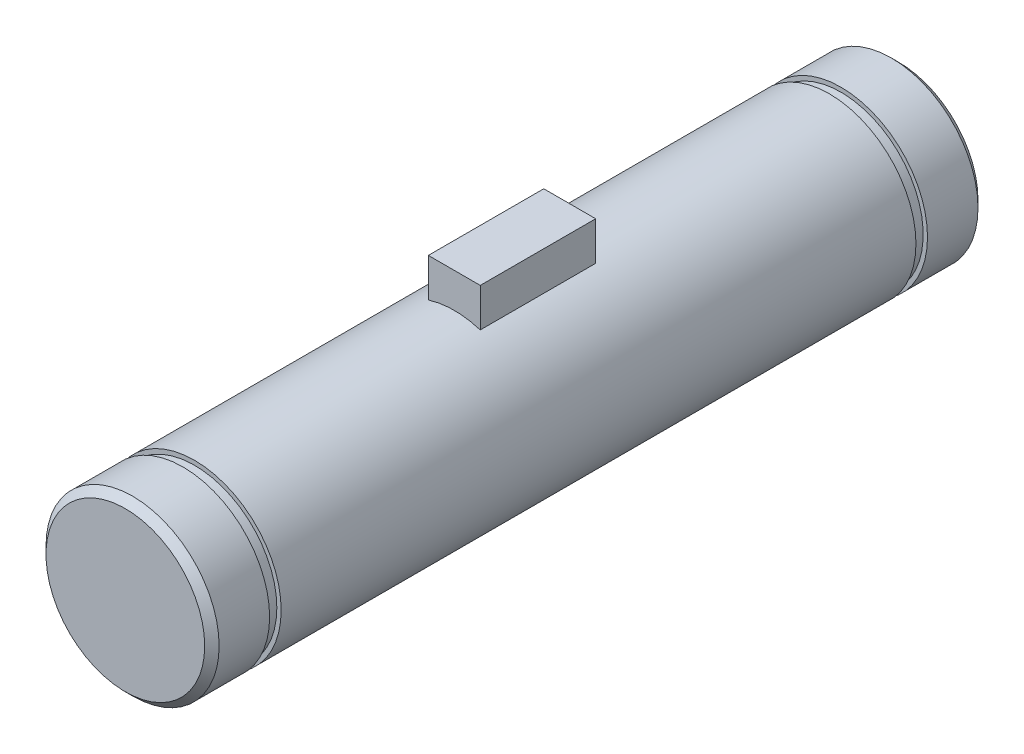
from build123d import *

# Parameters (mm, degrees)
SKETCH1_R           = 3
BOSS_EXTRUDE1_DEPTH = 26.8
BOSS_EXTRUDE2_START = -11.4
SKETCH2_W           = 1.8
SKETCH2_H           = 4.2
BOSS_EXTRUDE2_DEPTH = 4
CUT_EXTRUDE1_START  = -2
SKETCH3_R           = 3
SKETCH3_R_2         = 2.85
CUT_EXTRUDE1_DEPTH  = 0.4
CUT_EXTRUDE2_START  = -2.4
SKETCH4_R           = 3.000966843
SKETCH4_R_2         = 2.85
CUT_EXTRUDE2_DEPTH  = 0.4
CHAMFER1_SIZE       = 0.25


with BuildPart() as part:
    # Sketch1 → Boss-Extrude1 (new body)
    with BuildSketch(Plane.XY):
        Circle(SKETCH1_R)
    extrude(amount=BOSS_EXTRUDE1_DEPTH)

    # Sketch2 → Boss-Extrude2 (add)
    with BuildSketch(Plane(origin=(0, 0, 0), x_dir=(-1, 0, 0), z_dir=(0, 0, -1)).offset(BOSS_EXTRUDE2_START)):
        with Locations((0, 2.1)):
            Rectangle(SKETCH2_W, SKETCH2_H)
    extrude(amount=-BOSS_EXTRUDE2_DEPTH)

    # Sketch3 → Cut-Extrude1 (cut)
    with BuildSketch(Plane(origin=(0, 0, 0), x_dir=(-1, 0, 0), z_dir=(0, 0, -1)).offset(CUT_EXTRUDE1_START)):
        Circle(SKETCH3_R)
        Circle(SKETCH3_R_2, mode=Mode.SUBTRACT)
    extrude(amount=-CUT_EXTRUDE1_DEPTH, mode=Mode.SUBTRACT)

    # Sketch4 → Cut-Extrude2 (cut)
    with BuildSketch(Plane.XY.offset(26.8).offset(CUT_EXTRUDE2_START)):
        Circle(SKETCH4_R)
        with Locations(Location((0, 0, 0), (0, 0, 180))):
            Circle(SKETCH4_R_2, mode=Mode.SUBTRACT)
    extrude(amount=CUT_EXTRUDE2_DEPTH, mode=Mode.SUBTRACT)

    # Chamfer1
    chamfer1_edges = [part.edges().sort_by_distance(p)[0] for p in [
        (-3, 0, 0),
        (-3, 0, 26.8),
    ]]
    chamfer(chamfer1_edges, length=CHAMFER1_SIZE)


solid = part.part
